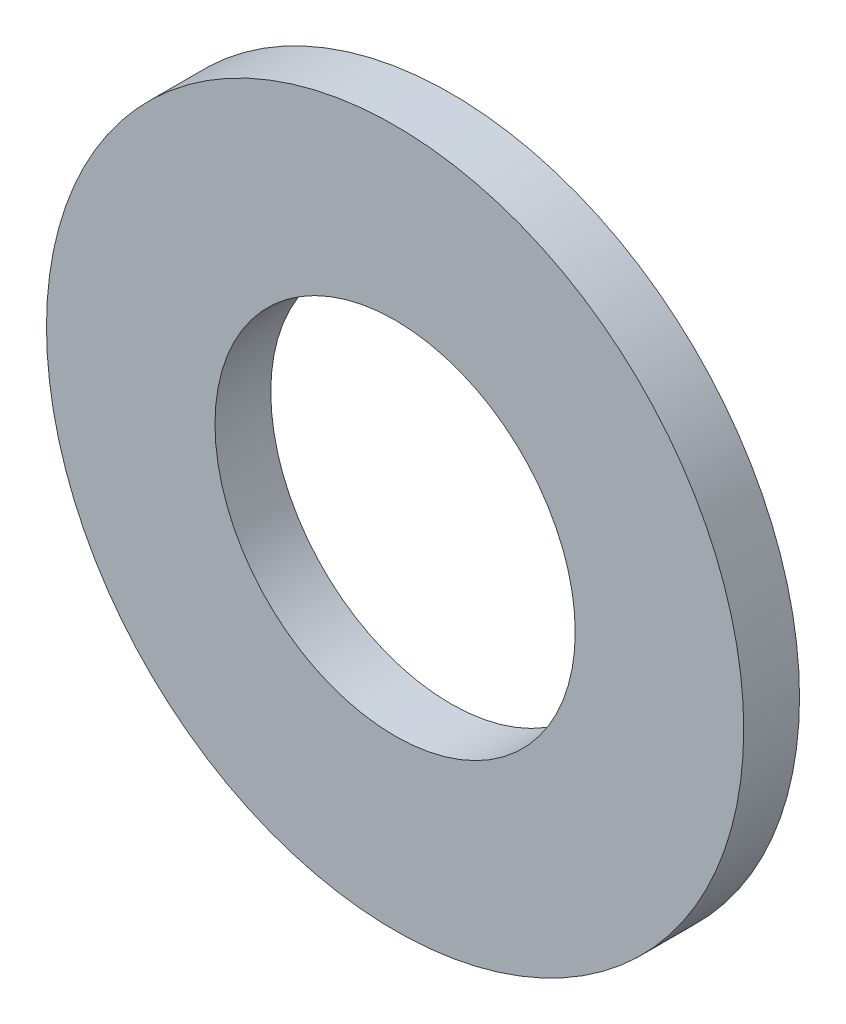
from build123d import *

# Parameters (mm, degrees)
SKETCH1_R      = 9.525
SKETCH1_R_2    = 4.92125
EXTRUDE1_DEPTH = 1.524


with BuildPart() as part:
    # Sketch1 → Extrude1 (new body)
    with BuildSketch(Plane.XY):
        with Locations(Location((0, 0, 0), (0, 0, 180))):
            Circle(SKETCH1_R)
        with Locations(Location((0, 0, 0), (0, 0, 180))):
            Circle(SKETCH1_R_2, mode=Mode.SUBTRACT)
    extrude(amount=EXTRUDE1_DEPTH)


solid = part.part
